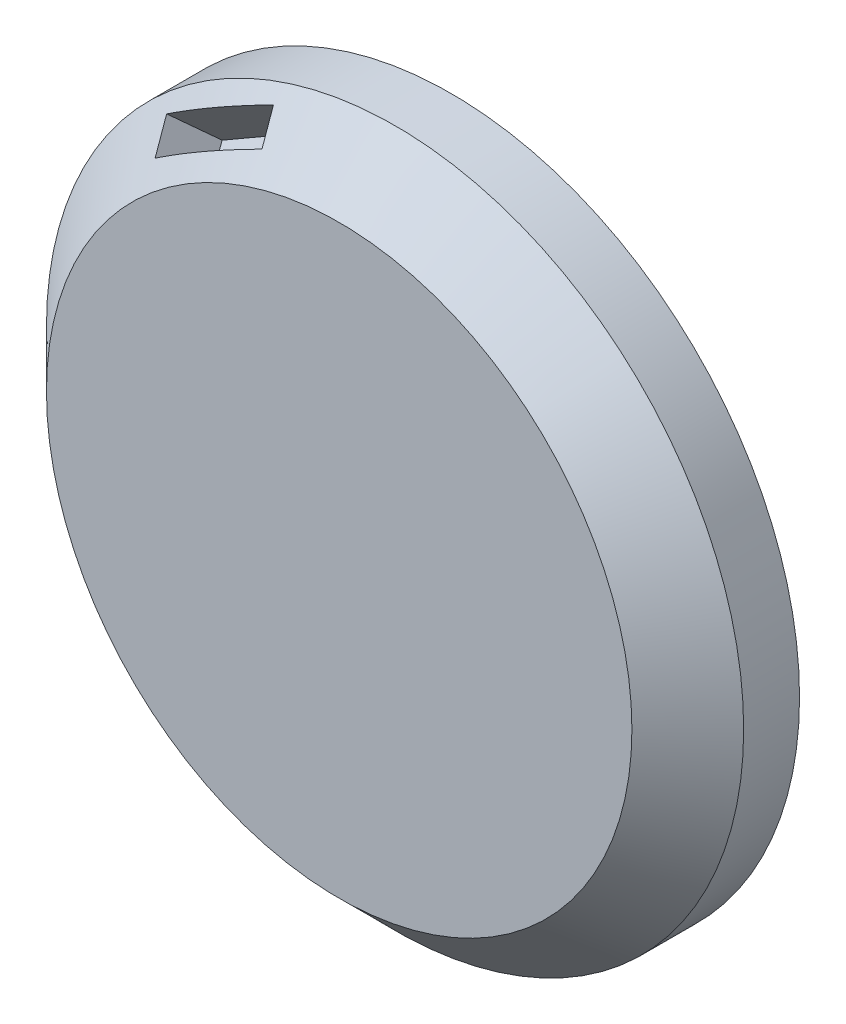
ISO-10303-21;
HEADER;
FILE_DESCRIPTION(('STEP AP214'),'2;1');
FILE_NAME('part.step','',(''),(''),'','','');
FILE_SCHEMA(('AUTOMOTIVE_DESIGN { 1 0 10303 214 1 1 1 1 }'));
ENDSEC;
DATA;
#1=APPLICATION_CONTEXT('core data for automotive mechanical design processes');
#2=APPLICATION_PROTOCOL_DEFINITION('international standard','automotive_design',2000,#1);
#3=PRODUCT_CONTEXT('',#1,'mechanical');
#4=PRODUCT('Part','Part','',(#3));
#5=PRODUCT_RELATED_PRODUCT_CATEGORY('part','',(#4));
#6=PRODUCT_DEFINITION_FORMATION('','',#4);
#7=PRODUCT_DEFINITION_CONTEXT('part definition',#1,'design');
#8=PRODUCT_DEFINITION('design','',#6,#7);
#9=PRODUCT_DEFINITION_SHAPE('','',#8);
#10=(LENGTH_UNIT() NAMED_UNIT(*) SI_UNIT(.MILLI.,.METRE.));
#11=(NAMED_UNIT(*) PLANE_ANGLE_UNIT() SI_UNIT($,.RADIAN.));
#12=(NAMED_UNIT(*) SI_UNIT($,.STERADIAN.) SOLID_ANGLE_UNIT());
#13=UNCERTAINTY_MEASURE_WITH_UNIT(LENGTH_MEASURE(1.E-05),#10,'distance_accuracy_value','');
#14=(GEOMETRIC_REPRESENTATION_CONTEXT(3) GLOBAL_UNCERTAINTY_ASSIGNED_CONTEXT((#13)) GLOBAL_UNIT_ASSIGNED_CONTEXT((#10,
#11,#12)) REPRESENTATION_CONTEXT('',''));
#15=CARTESIAN_POINT('',(0.,0.,0.));
#16=DIRECTION('',(0.,0.,1.));
#17=DIRECTION('',(1.,0.,0.));
#18=AXIS2_PLACEMENT_3D('',#15,#16,#17);
#19=CARTESIAN_POINT('',(0.,0.,-20.));
#20=DIRECTION('',(0.,0.,1.));
#21=DIRECTION('',(1.,0.,0.));
#22=AXIS2_PLACEMENT_3D('',#19,#20,#21);
#23=CYLINDRICAL_SURFACE('',#22,62.3893375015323);
#24=CARTESIAN_POINT('',(0.,0.,-10.));
#25=DIRECTION('',(0.,0.,1.));
#26=DIRECTION('',(1.,0.,0.));
#27=AXIS2_PLACEMENT_3D('',#24,#25,#26);
#28=CIRCLE('',#27,62.3893375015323);
#29=CARTESIAN_POINT('',(62.3893375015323,0.,-10.));
#30=VERTEX_POINT('',#29);
#31=EDGE_CURVE('E112',#30,#30,#28,.F.);
#32=ORIENTED_EDGE('',*,*,#31,.T.);
#33=EDGE_LOOP('',(#32));
#34=FACE_BOUND('',#33,.T.);
#35=CARTESIAN_POINT('',(0.,0.,-20.));
#36=DIRECTION('',(0.,0.,1.));
#37=DIRECTION('',(1.,0.,0.));
#38=AXIS2_PLACEMENT_3D('',#35,#36,#37);
#39=CIRCLE('',#38,62.3893375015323);
#40=CARTESIAN_POINT('',(62.3893375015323,0.,-20.));
#41=VERTEX_POINT('',#40);
#42=EDGE_CURVE('E103',#41,#41,#39,.T.);
#43=ORIENTED_EDGE('',*,*,#42,.T.);
#44=EDGE_LOOP('',(#43));
#45=FACE_BOUND('',#44,.T.);
#46=ADVANCED_FACE('F31',(#34,#45),#23,.T.);
#47=CARTESIAN_POINT('',(0.,0.,-20.));
#48=DIRECTION('',(0.,0.,1.));
#49=DIRECTION('',(1.,0.,0.));
#50=AXIS2_PLACEMENT_3D('',#47,#48,#49);
#51=PLANE('',#50);
#52=ORIENTED_EDGE('',*,*,#42,.F.);
#53=EDGE_LOOP('',(#52));
#54=FACE_BOUND('',#53,.T.);
#55=ADVANCED_FACE('F135',(#54),#51,.F.);
#56=CARTESIAN_POINT('',(0.,0.,0.));
#57=DIRECTION('',(0.,0.,1.));
#58=DIRECTION('',(1.,0.,0.));
#59=AXIS2_PLACEMENT_3D('',#56,#57,#58);
#60=PLANE('',#59);
#61=CARTESIAN_POINT('',(0.,0.,0.));
#62=DIRECTION('',(0.,0.,1.));
#63=DIRECTION('',(1.,0.,0.));
#64=AXIS2_PLACEMENT_3D('',#61,#62,#63);
#65=CIRCLE('',#64,52.3893375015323);
#66=CARTESIAN_POINT('',(52.3893375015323,0.,0.));
#67=VERTEX_POINT('',#66);
#68=EDGE_CURVE('E109',#67,#67,#65,.T.);
#69=ORIENTED_EDGE('',*,*,#68,.T.);
#70=EDGE_LOOP('',(#69));
#71=FACE_BOUND('',#70,.T.);
#72=ADVANCED_FACE('F138',(#71),#60,.T.);
#73=CARTESIAN_POINT('',(0.,0.,0.));
#74=DIRECTION('',(0.,0.,-1.));
#75=DIRECTION('',(-1.,0.,0.));
#76=AXIS2_PLACEMENT_3D('',#73,#74,#75);
#77=CONICAL_SURFACE('',#76,52.3893375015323,0.785398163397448);
#78=CARTESIAN_POINT('',(-18.4922071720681,57.4015173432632,-7.91734471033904));
#79=CARTESIAN_POINT('',(-19.3808575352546,57.0072169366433,-7.81449369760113));
#80=CARTESIAN_POINT('',(-20.2658797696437,56.601698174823,-7.72317212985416));
#81=CARTESIAN_POINT('',(-22.0275676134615,55.7684682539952,-7.5639264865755));
#82=CARTESIAN_POINT('',(-22.9042330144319,55.3407565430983,-7.4960029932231));
#83=CARTESIAN_POINT('',(-24.6439246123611,54.4654865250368,-7.3841632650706));
#84=CARTESIAN_POINT('',(-25.5069957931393,54.0180320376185,-7.3401346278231));
#85=CARTESIAN_POINT('',(-27.2226288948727,53.1018015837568,-7.27579692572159));
#86=CARTESIAN_POINT('',(-28.0751909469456,52.6330258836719,-7.25548756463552));
#87=CARTESIAN_POINT('',(-29.7687827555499,51.67463057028,-7.23868634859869));
#88=CARTESIAN_POINT('',(-30.6098122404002,51.1850104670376,-7.24219505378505));
#89=CARTESIAN_POINT('',(-32.2793269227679,50.185530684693,-7.27301259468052));
#90=CARTESIAN_POINT('',(-33.1078119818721,49.6756707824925,-7.30032169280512));
#91=CARTESIAN_POINT('',(-34.7552057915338,48.6339253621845,-7.37880278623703));
#92=CARTESIAN_POINT('',(-35.5740500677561,48.1019464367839,-7.4300879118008));
#93=CARTESIAN_POINT('',(-37.1972544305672,47.0190599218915,-7.55629296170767));
#94=CARTESIAN_POINT('',(-38.0016147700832,46.468152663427,-7.63121247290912));
#95=CARTESIAN_POINT('',(-38.798316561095,45.9081752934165,-7.71781620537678));
#96=B_SPLINE_CURVE_WITH_KNOTS('',3,(#78,#79,#80,#81,#82,#83,#84,#85,#86,#87,#88,#89,#90,#91,#92,
#93,#94,#95),.UNSPECIFIED.,.F.,.F.,(4,2,2,2,2,2,2,2,4),(0.,2.93275681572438,5.86558659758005,
8.78449792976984,11.7033728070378,14.6223163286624,17.5412920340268,20.4741820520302,
23.4070208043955),.UNSPECIFIED.);
#97=CARTESIAN_POINT('',(-19.5639177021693,56.9197340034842,-7.79872605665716));
#98=VERTEX_POINT('',#97);
#99=CARTESIAN_POINT('',(-38.5726262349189,46.0664145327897,-7.69362216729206));
#100=VERTEX_POINT('',#99);
#101=EDGE_CURVE('E115',#98,#100,#96,.T.);
#102=ORIENTED_EDGE('',*,*,#101,.F.);
#103=CARTESIAN_POINT('',(-17.1200698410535,52.6868653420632,-3.00924164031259));
#104=CARTESIAN_POINT('',(-17.3471233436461,53.0801335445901,-3.45342757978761));
#105=CARTESIAN_POINT('',(-17.5741167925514,53.4732977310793,-3.89773629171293));
#106=CARTESIAN_POINT('',(-18.0279913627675,54.2594315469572,-4.7865829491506));
#107=CARTESIAN_POINT('',(-18.2548724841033,54.6524011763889,-5.23112089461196));
#108=CARTESIAN_POINT('',(-18.708530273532,55.4381595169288,-6.12040989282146));
#109=CARTESIAN_POINT('',(-18.9353069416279,55.830948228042,-6.56516094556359));
#110=CARTESIAN_POINT('',(-19.3887626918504,56.6163566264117,-7.45486220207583));
#111=CARTESIAN_POINT('',(-19.6154417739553,57.0089763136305,-7.8998124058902));
#112=CARTESIAN_POINT('',(-19.8420754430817,57.4015173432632,-8.34485510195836));
#113=B_SPLINE_CURVE_WITH_KNOTS('',3,(#103,#104,#105,#106,#107,#108,#109,#110,#111,#112),
.UNSPECIFIED.,.F.,.F.,(4,2,2,2,4),(0.,1.90568327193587,3.81136612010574,5.71704891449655,
7.62273213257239),.UNSPECIFIED.);
#114=CARTESIAN_POINT('',(-17.4260716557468,53.2168760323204,-3.60801840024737));
#115=VERTEX_POINT('',#114);
#116=EDGE_CURVE('E11',#115,#98,#113,.T.);
#117=ORIENTED_EDGE('',*,*,#116,.F.);
#118=CARTESIAN_POINT('',(-36.6817166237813,42.1977246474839,-3.52306094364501));
#119=CARTESIAN_POINT('',(-35.884128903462,42.7666674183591,-3.42913591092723));
#120=CARTESIAN_POINT('',(-35.0780678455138,43.3258519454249,-3.34789843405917));
#121=CARTESIAN_POINT('',(-33.449962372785,44.4237599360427,-3.21113495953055));
#122=CARTESIAN_POINT('',(-32.6279175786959,44.9624829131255,-3.15560957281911));
#123=CARTESIAN_POINT('',(-30.973451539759,46.015564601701,-3.07084709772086));
#124=CARTESIAN_POINT('',(-30.1411132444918,46.5300419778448,-3.04146576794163));
#125=CARTESIAN_POINT('',(-28.4627349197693,47.536976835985,-3.00862376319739));
#126=CARTESIAN_POINT('',(-27.6166950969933,48.0294346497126,-3.00516269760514));
#127=CARTESIAN_POINT('',(-25.9121104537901,48.9916155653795,-3.02418190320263));
#128=CARTESIAN_POINT('',(-25.0535660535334,49.4613394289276,-3.04666130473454));
#129=CARTESIAN_POINT('',(-23.3251770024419,50.3775061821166,-3.11743214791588));
#130=CARTESIAN_POINT('',(-22.4553321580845,50.8239486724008,-3.16572403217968));
#131=CARTESIAN_POINT('',(-20.7007578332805,51.6955285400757,-3.2882008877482));
#132=CARTESIAN_POINT('',(-19.8159723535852,52.1205329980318,-3.36252897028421));
#133=CARTESIAN_POINT('',(-18.0376492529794,52.9462649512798,-3.53658567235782));
#134=CARTESIAN_POINT('',(-17.1441119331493,53.346993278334,-3.63631342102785));
#135=CARTESIAN_POINT('',(-16.2468474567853,53.7354587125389,-3.7485247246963));
#136=B_SPLINE_CURVE_WITH_KNOTS('',3,(#118,#119,#120,#121,#122,#123,#124,#125,#126,#127,#128,
#129,#130,#131,#132,#133,#134,#135),.UNSPECIFIED.,.F.,.F.,(4,2,2,2,2,2,2,2,4),(0.,
2.95247811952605,5.90502638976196,8.8411820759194,11.7772935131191,14.7133065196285,
17.6493698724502,20.6018316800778,23.5541922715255),.UNSPECIFIED.);
#137=CARTESIAN_POINT('',(-36.4387958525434,42.3705118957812,-3.49488318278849));
#138=VERTEX_POINT('',#137);
#139=EDGE_CURVE('E44',#138,#115,#136,.T.);
#140=ORIENTED_EDGE('',*,*,#139,.F.);
#141=CARTESIAN_POINT('',(-38.7982320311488,46.457175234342,-8.13811031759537));
#142=CARTESIAN_POINT('',(-38.5811661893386,46.081206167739,-7.71039998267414));
#143=CARTESIAN_POINT('',(-38.3640662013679,45.7051779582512,-7.282758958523));
#144=CARTESIAN_POINT('',(-37.9297930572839,44.952994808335,-6.42762565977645));
#145=CARTESIAN_POINT('',(-37.7126199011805,44.5768398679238,-6.00013338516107));
#146=CARTESIAN_POINT('',(-37.2781954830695,43.8243947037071,-5.14530759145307));
#147=CARTESIAN_POINT('',(-37.0609442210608,43.4481044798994,-4.71797407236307));
#148=CARTESIAN_POINT('',(-36.6263579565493,42.695378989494,-3.86347727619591));
#149=CARTESIAN_POINT('',(-36.4090229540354,42.3189437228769,-3.43631399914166));
#150=CARTESIAN_POINT('',(-36.1916432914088,41.9424311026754,-3.00924164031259));
#151=B_SPLINE_CURVE_WITH_KNOTS('',3,(#141,#142,#143,#144,#145,#146,#147,#148,#149,#150),
.UNSPECIFIED.,.F.,.F.,(4,2,2,2,4),(0.,1.82829375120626,3.65658725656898,5.4848807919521,
7.31317457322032),.UNSPECIFIED.);
#152=EDGE_CURVE('E121',#100,#138,#151,.T.);
#153=ORIENTED_EDGE('',*,*,#152,.F.);
#154=EDGE_LOOP('',(#102,#117,#140,#153));
#155=FACE_BOUND('',#154,.T.);
#156=ORIENTED_EDGE('',*,*,#31,.F.);
#157=EDGE_LOOP('',(#156));
#158=FACE_BOUND('',#157,.T.);
#159=ORIENTED_EDGE('',*,*,#68,.F.);
#160=EDGE_LOOP('',(#159));
#161=FACE_BOUND('',#160,.T.);
#162=ADVANCED_FACE('F33',(#155,#158,#161),#77,.T.);
#163=CARTESIAN_POINT('',(-14.1898261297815,47.6115343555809,-10.0805094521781));
#164=DIRECTION('',(0.866025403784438,0.500000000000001,0.));
#165=DIRECTION('',(-0.500000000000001,0.866025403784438,0.));
#166=AXIS2_PLACEMENT_3D('',#163,#164,#165);
#167=PLANE('',#166);
#168=ORIENTED_EDGE('',*,*,#116,.T.);
#169=DIRECTION('',(-0.353553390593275,0.612372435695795,0.707106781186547));
#170=VECTOR('',#169,1.);
#171=CARTESIAN_POINT('',(-16.3064260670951,51.2775929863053,-14.3137093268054));
#172=LINE('',#171,#170);
#173=CARTESIAN_POINT('',(-16.3064260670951,51.2775929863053,-14.3137093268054));
#174=VERTEX_POINT('',#173);
#175=EDGE_CURVE('E76',#174,#98,#172,.T.);
#176=ORIENTED_EDGE('',*,*,#175,.F.);
#177=DIRECTION('',(-0.353553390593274,0.612372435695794,-0.707106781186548));
#178=VECTOR('',#177,1.);
#179=CARTESIAN_POINT('',(-14.1898261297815,47.6115343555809,-10.0805094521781));
#180=LINE('',#179,#178);
#181=CARTESIAN_POINT('',(-14.1898261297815,47.6115343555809,-10.0805094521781));
#182=VERTEX_POINT('',#181);
#183=EDGE_CURVE('E80',#182,#174,#180,.T.);
#184=ORIENTED_EDGE('',*,*,#183,.F.);
#185=DIRECTION('',(-0.353553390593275,0.612372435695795,0.707106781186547));
#186=VECTOR('',#185,1.);
#187=CARTESIAN_POINT('',(-14.1898261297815,47.6115343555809,-10.0805094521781));
#188=LINE('',#187,#186);
#189=EDGE_CURVE('E101',#182,#115,#188,.T.);
#190=ORIENTED_EDGE('',*,*,#189,.T.);
#191=EDGE_LOOP('',(#168,#176,#184,#190));
#192=FACE_BOUND('',#191,.T.);
#193=ADVANCED_FACE('F78',(#192),#167,.F.);
#194=CARTESIAN_POINT('',(-14.1898261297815,47.6115343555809,-10.0805094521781));
#195=DIRECTION('',(0.353553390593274,-0.612372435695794,0.707106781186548));
#196=DIRECTION('',(0.,-0.755928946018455,-0.654653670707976));
#197=AXIS2_PLACEMENT_3D('',#194,#195,#196);
#198=PLANE('',#197);
#199=DIRECTION('',(-0.353553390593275,0.612372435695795,0.707106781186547));
#200=VECTOR('',#199,1.);
#201=CARTESIAN_POINT('',(-33.1459827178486,36.6671922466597,-10.0805094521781));
#202=LINE('',#201,#200);
#203=CARTESIAN_POINT('',(-33.1459827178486,36.6671922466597,-10.0805094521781));
#204=VERTEX_POINT('',#203);
#205=EDGE_CURVE('E104',#204,#138,#202,.T.);
#206=ORIENTED_EDGE('',*,*,#205,.T.);
#207=ORIENTED_EDGE('',*,*,#139,.T.);
#208=ORIENTED_EDGE('',*,*,#189,.F.);
#209=DIRECTION('',(0.866025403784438,0.500000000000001,0.));
#210=VECTOR('',#209,1.);
#211=CARTESIAN_POINT('',(-14.1898261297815,47.6115343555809,-10.0805094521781));
#212=LINE('',#211,#210);
#213=EDGE_CURVE('E84',#204,#182,#212,.T.);
#214=ORIENTED_EDGE('',*,*,#213,.F.);
#215=EDGE_LOOP('',(#206,#207,#208,#214));
#216=FACE_BOUND('',#215,.T.);
#217=ADVANCED_FACE('F134',(#216),#198,.F.);
#218=CARTESIAN_POINT('',(-33.1459827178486,36.6671922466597,-10.0805094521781));
#219=DIRECTION('',(-0.866025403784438,-0.500000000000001,0.));
#220=DIRECTION('',(0.500000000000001,-0.866025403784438,0.));
#221=AXIS2_PLACEMENT_3D('',#218,#219,#220);
#222=PLANE('',#221);
#223=ORIENTED_EDGE('',*,*,#152,.T.);
#224=ORIENTED_EDGE('',*,*,#205,.F.);
#225=DIRECTION('',(0.353553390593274,-0.612372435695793,0.707106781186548));
#226=VECTOR('',#225,1.);
#227=CARTESIAN_POINT('',(-33.1459827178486,36.6671922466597,-10.0805094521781));
#228=LINE('',#227,#226);
#229=CARTESIAN_POINT('',(-35.2625826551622,40.333250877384,-14.3137093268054));
#230=VERTEX_POINT('',#229);
#231=EDGE_CURVE('E93',#230,#204,#228,.T.);
#232=ORIENTED_EDGE('',*,*,#231,.F.);
#233=DIRECTION('',(-0.353553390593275,0.612372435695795,0.707106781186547));
#234=VECTOR('',#233,1.);
#235=CARTESIAN_POINT('',(-35.2625826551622,40.333250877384,-14.3137093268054));
#236=LINE('',#235,#234);
#237=EDGE_CURVE('E83',#230,#100,#236,.T.);
#238=ORIENTED_EDGE('',*,*,#237,.T.);
#239=EDGE_LOOP('',(#223,#224,#232,#238));
#240=FACE_BOUND('',#239,.T.);
#241=ADVANCED_FACE('F128',(#240),#222,.F.);
#242=CARTESIAN_POINT('',(-16.3064260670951,51.2775929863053,-14.3137093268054));
#243=DIRECTION('',(-0.353553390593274,0.612372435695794,-0.707106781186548));
#244=DIRECTION('',(0.,0.755928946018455,0.654653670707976));
#245=AXIS2_PLACEMENT_3D('',#242,#243,#244);
#246=PLANE('',#245);
#247=ORIENTED_EDGE('',*,*,#175,.T.);
#248=ORIENTED_EDGE('',*,*,#101,.T.);
#249=ORIENTED_EDGE('',*,*,#237,.F.);
#250=DIRECTION('',(-0.866025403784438,-0.500000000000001,0.));
#251=VECTOR('',#250,1.);
#252=CARTESIAN_POINT('',(-16.3064260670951,51.2775929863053,-14.3137093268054));
#253=LINE('',#252,#251);
#254=EDGE_CURVE('E87',#174,#230,#253,.T.);
#255=ORIENTED_EDGE('',*,*,#254,.F.);
#256=EDGE_LOOP('',(#247,#248,#249,#255));
#257=FACE_BOUND('',#256,.T.);
#258=ADVANCED_FACE('F88',(#257),#246,.F.);
#259=CARTESIAN_POINT('',(-16.3064260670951,51.2775929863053,-14.3137093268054));
#260=DIRECTION('',(-0.353553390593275,0.612372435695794,0.707106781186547));
#261=DIRECTION('',(0.,-0.755928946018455,0.654653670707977));
#262=AXIS2_PLACEMENT_3D('',#259,#260,#261);
#263=PLANE('',#262);
#264=ORIENTED_EDGE('',*,*,#183,.T.);
#265=ORIENTED_EDGE('',*,*,#254,.T.);
#266=ORIENTED_EDGE('',*,*,#231,.T.);
#267=ORIENTED_EDGE('',*,*,#213,.T.);
#268=EDGE_LOOP('',(#264,#265,#266,#267));
#269=FACE_BOUND('',#268,.T.);
#270=ADVANCED_FACE('F95',(#269),#263,.T.);
#271=CLOSED_SHELL('',(#46,#55,#72,#162,#193,#217,#241,#258,#270));
#272=MANIFOLD_SOLID_BREP('B2',#271);
#273=ADVANCED_BREP_SHAPE_REPRESENTATION('',(#18,#272),#14);
#274=SHAPE_DEFINITION_REPRESENTATION(#9,#273);
ENDSEC;
END-ISO-10303-21;
